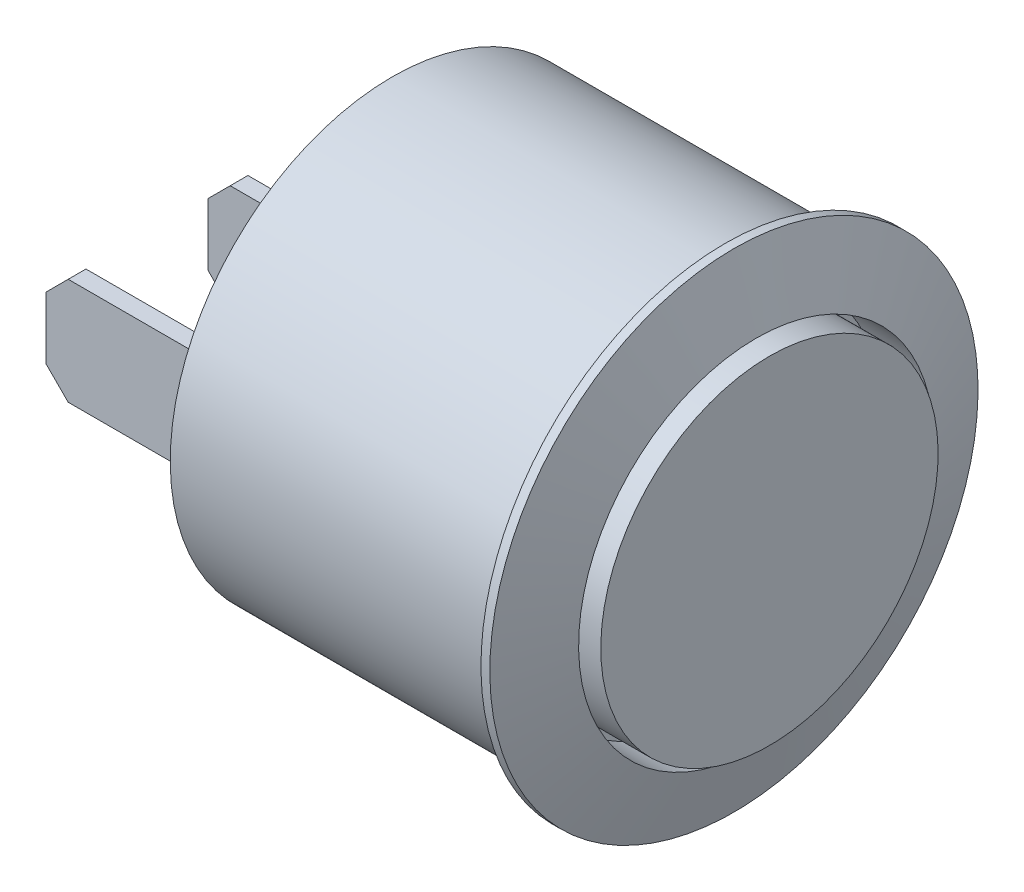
ISO-10303-21;
HEADER;
FILE_DESCRIPTION(('STEP AP214'),'2;1');
FILE_NAME('part.step','',(''),(''),'','','');
FILE_SCHEMA(('AUTOMOTIVE_DESIGN { 1 0 10303 214 1 1 1 1 }'));
ENDSEC;
DATA;
#1=APPLICATION_CONTEXT('core data for automotive mechanical design processes');
#2=APPLICATION_PROTOCOL_DEFINITION('international standard','automotive_design',2000,#1);
#3=PRODUCT_CONTEXT('',#1,'mechanical');
#4=PRODUCT('Part','Part','',(#3));
#5=PRODUCT_RELATED_PRODUCT_CATEGORY('part','',(#4));
#6=PRODUCT_DEFINITION_FORMATION('','',#4);
#7=PRODUCT_DEFINITION_CONTEXT('part definition',#1,'design');
#8=PRODUCT_DEFINITION('design','',#6,#7);
#9=PRODUCT_DEFINITION_SHAPE('','',#8);
#10=(LENGTH_UNIT() NAMED_UNIT(*) SI_UNIT(.MILLI.,.METRE.));
#11=(NAMED_UNIT(*) PLANE_ANGLE_UNIT() SI_UNIT($,.RADIAN.));
#12=(NAMED_UNIT(*) SI_UNIT($,.STERADIAN.) SOLID_ANGLE_UNIT());
#13=UNCERTAINTY_MEASURE_WITH_UNIT(LENGTH_MEASURE(1.E-05),#10,'distance_accuracy_value','');
#14=(GEOMETRIC_REPRESENTATION_CONTEXT(3) GLOBAL_UNCERTAINTY_ASSIGNED_CONTEXT((#13)) GLOBAL_UNIT_ASSIGNED_CONTEXT((#10,
#11,#12)) REPRESENTATION_CONTEXT('',''));
#15=CARTESIAN_POINT('',(0.,0.,0.));
#16=DIRECTION('',(0.,0.,1.));
#17=DIRECTION('',(1.,0.,0.));
#18=AXIS2_PLACEMENT_3D('',#15,#16,#17);
#19=CARTESIAN_POINT('',(-33.2098061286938,0.,0.));
#20=DIRECTION('',(-1.,0.,0.));
#21=DIRECTION('',(0.,-1.,0.));
#22=AXIS2_PLACEMENT_3D('',#19,#20,#21);
#23=PLANE('',#22);
#24=DIRECTION('',(0.,0.,1.));
#25=VECTOR('',#24,1.);
#26=CARTESIAN_POINT('',(-33.2098061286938,-2.4,6.8));
#27=LINE('',#26,#25);
#28=CARTESIAN_POINT('',(-33.2098061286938,-2.4,6.8));
#29=VERTEX_POINT('',#28);
#30=CARTESIAN_POINT('',(-33.2098061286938,-2.4,7.6));
#31=VERTEX_POINT('',#30);
#32=EDGE_CURVE('E202',#29,#31,#27,.T.);
#33=ORIENTED_EDGE('',*,*,#32,.F.);
#34=DIRECTION('',(0.,-1.,0.));
#35=VECTOR('',#34,1.);
#36=CARTESIAN_POINT('',(-33.2098061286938,2.4,6.8));
#37=LINE('',#36,#35);
#38=CARTESIAN_POINT('',(-33.2098061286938,2.4,6.8));
#39=VERTEX_POINT('',#38);
#40=EDGE_CURVE('E166',#39,#29,#37,.T.);
#41=ORIENTED_EDGE('',*,*,#40,.F.);
#42=DIRECTION('',(0.,0.,-1.));
#43=VECTOR('',#42,1.);
#44=CARTESIAN_POINT('',(-33.2098061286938,2.4,6.8));
#45=LINE('',#44,#43);
#46=CARTESIAN_POINT('',(-33.2098061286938,2.4,7.6));
#47=VERTEX_POINT('',#46);
#48=EDGE_CURVE('E196',#47,#39,#45,.T.);
#49=ORIENTED_EDGE('',*,*,#48,.F.);
#50=DIRECTION('',(0.,1.,0.));
#51=VECTOR('',#50,1.);
#52=CARTESIAN_POINT('',(-33.2098061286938,2.4,7.6));
#53=LINE('',#52,#51);
#54=EDGE_CURVE('E205',#31,#47,#53,.T.);
#55=ORIENTED_EDGE('',*,*,#54,.F.);
#56=EDGE_LOOP('',(#33,#41,#49,#55));
#57=FACE_BOUND('',#56,.T.);
#58=CARTESIAN_POINT('',(-33.2098061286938,0.,0.));
#59=DIRECTION('',(1.,0.,0.));
#60=DIRECTION('',(0.,1.,0.));
#61=AXIS2_PLACEMENT_3D('',#58,#59,#60);
#62=CIRCLE('',#61,10.);
#63=CARTESIAN_POINT('',(-33.2098061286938,10.,0.));
#64=VERTEX_POINT('',#63);
#65=EDGE_CURVE('E264',#64,#64,#62,.T.);
#66=ORIENTED_EDGE('',*,*,#65,.F.);
#67=EDGE_LOOP('',(#66));
#68=FACE_BOUND('',#67,.T.);
#69=DIRECTION('',(0.,0.,1.));
#70=VECTOR('',#69,1.);
#71=CARTESIAN_POINT('',(-33.2098061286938,-2.4,-0.5));
#72=LINE('',#71,#70);
#73=CARTESIAN_POINT('',(-33.2098061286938,-2.4,-0.5));
#74=VERTEX_POINT('',#73);
#75=CARTESIAN_POINT('',(-33.2098061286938,-2.4,0.3));
#76=VERTEX_POINT('',#75);
#77=EDGE_CURVE('E228',#74,#76,#72,.T.);
#78=ORIENTED_EDGE('',*,*,#77,.F.);
#79=DIRECTION('',(0.,-1.,0.));
#80=VECTOR('',#79,1.);
#81=CARTESIAN_POINT('',(-33.2098061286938,2.4,-0.5));
#82=LINE('',#81,#80);
#83=CARTESIAN_POINT('',(-33.2098061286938,2.4,-0.5));
#84=VERTEX_POINT('',#83);
#85=EDGE_CURVE('E217',#84,#74,#82,.T.);
#86=ORIENTED_EDGE('',*,*,#85,.F.);
#87=DIRECTION('',(0.,0.,-1.));
#88=VECTOR('',#87,1.);
#89=CARTESIAN_POINT('',(-33.2098061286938,2.4,-0.5));
#90=LINE('',#89,#88);
#91=CARTESIAN_POINT('',(-33.2098061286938,2.4,0.3));
#92=VERTEX_POINT('',#91);
#93=EDGE_CURVE('E222',#92,#84,#90,.T.);
#94=ORIENTED_EDGE('',*,*,#93,.F.);
#95=DIRECTION('',(0.,1.,0.));
#96=VECTOR('',#95,1.);
#97=CARTESIAN_POINT('',(-33.2098061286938,2.4,0.3));
#98=LINE('',#97,#96);
#99=EDGE_CURVE('E231',#76,#92,#98,.T.);
#100=ORIENTED_EDGE('',*,*,#99,.F.);
#101=EDGE_LOOP('',(#78,#86,#94,#100));
#102=FACE_BOUND('',#101,.T.);
#103=DIRECTION('',(0.,-1.,0.));
#104=VECTOR('',#103,1.);
#105=CARTESIAN_POINT('',(-33.2098061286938,2.4,-7.8));
#106=LINE('',#105,#104);
#107=CARTESIAN_POINT('',(-33.2098061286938,2.4,-7.8));
#108=VERTEX_POINT('',#107);
#109=CARTESIAN_POINT('',(-33.2098061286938,-2.4,-7.8));
#110=VERTEX_POINT('',#109);
#111=EDGE_CURVE('E162',#108,#110,#106,.T.);
#112=ORIENTED_EDGE('',*,*,#111,.F.);
#113=DIRECTION('',(0.,0.,-1.));
#114=VECTOR('',#113,1.);
#115=CARTESIAN_POINT('',(-33.2098061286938,2.4,-7.));
#116=LINE('',#115,#114);
#117=CARTESIAN_POINT('',(-33.2098061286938,2.4,-7.));
#118=VERTEX_POINT('',#117);
#119=EDGE_CURVE('E170',#118,#108,#116,.T.);
#120=ORIENTED_EDGE('',*,*,#119,.F.);
#121=DIRECTION('',(0.,1.,0.));
#122=VECTOR('',#121,1.);
#123=CARTESIAN_POINT('',(-33.2098061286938,2.4,-7.));
#124=LINE('',#123,#122);
#125=CARTESIAN_POINT('',(-33.2098061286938,-2.4,-7.));
#126=VERTEX_POINT('',#125);
#127=EDGE_CURVE('E181',#126,#118,#124,.T.);
#128=ORIENTED_EDGE('',*,*,#127,.F.);
#129=DIRECTION('',(0.,0.,1.));
#130=VECTOR('',#129,1.);
#131=CARTESIAN_POINT('',(-33.2098061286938,-2.4,-7.));
#132=LINE('',#131,#130);
#133=EDGE_CURVE('E179',#110,#126,#132,.T.);
#134=ORIENTED_EDGE('',*,*,#133,.F.);
#135=EDGE_LOOP('',(#112,#120,#128,#134));
#136=FACE_BOUND('',#135,.T.);
#137=ADVANCED_FACE('F35',(#57,#68,#102,#136),#23,.T.);
#138=CARTESIAN_POINT('',(-19.2098061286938,8.,0.));
#139=DIRECTION('',(1.,0.,0.));
#140=DIRECTION('',(0.,1.,0.));
#141=AXIS2_PLACEMENT_3D('',#138,#139,#140);
#142=PLANE('',#141);
#143=CARTESIAN_POINT('',(-19.2098061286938,0.,0.));
#144=DIRECTION('',(1.,0.,0.));
#145=DIRECTION('',(0.,1.,0.));
#146=AXIS2_PLACEMENT_3D('',#143,#144,#145);
#147=CIRCLE('',#146,8.);
#148=CARTESIAN_POINT('',(-19.2098061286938,8.,0.));
#149=VERTEX_POINT('',#148);
#150=EDGE_CURVE('E247',#149,#149,#147,.T.);
#151=ORIENTED_EDGE('',*,*,#150,.T.);
#152=EDGE_LOOP('',(#151));
#153=FACE_BOUND('',#152,.T.);
#154=CARTESIAN_POINT('',(-19.2098061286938,0.,0.));
#155=DIRECTION('',(1.,0.,0.));
#156=DIRECTION('',(0.,1.,0.));
#157=AXIS2_PLACEMENT_3D('',#154,#155,#156);
#158=CIRCLE('',#157,7.6);
#159=CARTESIAN_POINT('',(-19.2098061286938,7.6,0.));
#160=VERTEX_POINT('',#159);
#161=EDGE_CURVE('E243',#160,#160,#158,.T.);
#162=ORIENTED_EDGE('',*,*,#161,.F.);
#163=EDGE_LOOP('',(#162));
#164=FACE_BOUND('',#163,.T.);
#165=ADVANCED_FACE('F336',(#153,#164),#142,.T.);
#166=CARTESIAN_POINT('',(-19.2098061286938,0.,0.));
#167=DIRECTION('',(1.,0.,0.));
#168=DIRECTION('',(0.,1.,0.));
#169=AXIS2_PLACEMENT_3D('',#166,#167,#168);
#170=CYLINDRICAL_SURFACE('',#169,10.);
#171=ORIENTED_EDGE('',*,*,#65,.T.);
#172=EDGE_LOOP('',(#171));
#173=FACE_BOUND('',#172,.T.);
#174=CARTESIAN_POINT('',(-18.2098061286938,0.,0.));
#175=DIRECTION('',(1.,0.,0.));
#176=DIRECTION('',(0.,1.,0.));
#177=AXIS2_PLACEMENT_3D('',#174,#175,#176);
#178=CIRCLE('',#177,10.);
#179=CARTESIAN_POINT('',(-18.2098061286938,10.,0.));
#180=VERTEX_POINT('',#179);
#181=EDGE_CURVE('E261',#180,#180,#178,.T.);
#182=ORIENTED_EDGE('',*,*,#181,.F.);
#183=EDGE_LOOP('',(#182));
#184=FACE_BOUND('',#183,.T.);
#185=ADVANCED_FACE('F342',(#173,#184),#170,.T.);
#186=CARTESIAN_POINT('',(-18.2098061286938,10.,0.));
#187=DIRECTION('',(-1.,0.,0.));
#188=DIRECTION('',(0.,-1.,0.));
#189=AXIS2_PLACEMENT_3D('',#186,#187,#188);
#190=PLANE('',#189);
#191=ORIENTED_EDGE('',*,*,#181,.T.);
#192=EDGE_LOOP('',(#191));
#193=FACE_BOUND('',#192,.T.);
#194=CARTESIAN_POINT('',(-18.2098061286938,0.,0.));
#195=DIRECTION('',(1.,0.,0.));
#196=DIRECTION('',(0.,1.,0.));
#197=AXIS2_PLACEMENT_3D('',#194,#195,#196);
#198=CIRCLE('',#197,11.);
#199=CARTESIAN_POINT('',(-18.2098061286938,11.,0.));
#200=VERTEX_POINT('',#199);
#201=EDGE_CURVE('E258',#200,#200,#198,.T.);
#202=ORIENTED_EDGE('',*,*,#201,.F.);
#203=EDGE_LOOP('',(#202));
#204=FACE_BOUND('',#203,.T.);
#205=ADVANCED_FACE('F423',(#193,#204),#190,.T.);
#206=CARTESIAN_POINT('',(-19.2098061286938,0.,0.));
#207=DIRECTION('',(1.,0.,0.));
#208=DIRECTION('',(0.,1.,0.));
#209=AXIS2_PLACEMENT_3D('',#206,#207,#208);
#210=CYLINDRICAL_SURFACE('',#209,11.);
#211=ORIENTED_EDGE('',*,*,#201,.T.);
#212=EDGE_LOOP('',(#211));
#213=FACE_BOUND('',#212,.T.);
#214=CARTESIAN_POINT('',(-17.8098061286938,0.,0.));
#215=DIRECTION('',(1.,0.,0.));
#216=DIRECTION('',(0.,1.,0.));
#217=AXIS2_PLACEMENT_3D('',#214,#215,#216);
#218=CIRCLE('',#217,11.);
#219=CARTESIAN_POINT('',(-17.8098061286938,11.,0.));
#220=VERTEX_POINT('',#219);
#221=EDGE_CURVE('E255',#220,#220,#218,.T.);
#222=ORIENTED_EDGE('',*,*,#221,.F.);
#223=EDGE_LOOP('',(#222));
#224=FACE_BOUND('',#223,.T.);
#225=ADVANCED_FACE('F420',(#213,#224),#210,.T.);
#226=CARTESIAN_POINT('',(-16.8098061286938,0.,0.));
#227=DIRECTION('',(-1.,0.,0.));
#228=DIRECTION('',(0.,-1.,0.));
#229=AXIS2_PLACEMENT_3D('',#226,#227,#228);
#230=CONICAL_SURFACE('',#229,8.,1.24904577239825);
#231=ORIENTED_EDGE('',*,*,#221,.T.);
#232=EDGE_LOOP('',(#231));
#233=FACE_BOUND('',#232,.T.);
#234=CARTESIAN_POINT('',(-16.8098061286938,0.,0.));
#235=DIRECTION('',(1.,0.,0.));
#236=DIRECTION('',(0.,1.,0.));
#237=AXIS2_PLACEMENT_3D('',#234,#235,#236);
#238=CIRCLE('',#237,8.);
#239=CARTESIAN_POINT('',(-16.8098061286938,8.,0.));
#240=VERTEX_POINT('',#239);
#241=EDGE_CURVE('E252',#240,#240,#238,.T.);
#242=ORIENTED_EDGE('',*,*,#241,.F.);
#243=EDGE_LOOP('',(#242));
#244=FACE_BOUND('',#243,.T.);
#245=ADVANCED_FACE('F416',(#233,#244),#230,.T.);
#246=CARTESIAN_POINT('',(-19.2098061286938,0.,0.));
#247=DIRECTION('',(1.,0.,0.));
#248=DIRECTION('',(0.,1.,0.));
#249=AXIS2_PLACEMENT_3D('',#246,#247,#248);
#250=CYLINDRICAL_SURFACE('',#249,8.);
#251=ORIENTED_EDGE('',*,*,#241,.T.);
#252=EDGE_LOOP('',(#251));
#253=FACE_BOUND('',#252,.T.);
#254=ORIENTED_EDGE('',*,*,#150,.F.);
#255=EDGE_LOOP('',(#254));
#256=FACE_BOUND('',#255,.T.);
#257=ADVANCED_FACE('F411',(#253,#256),#250,.F.);
#258=CARTESIAN_POINT('',(-16.2098061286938,0.,0.));
#259=DIRECTION('',(-1.,0.,0.));
#260=DIRECTION('',(0.,-1.,0.));
#261=AXIS2_PLACEMENT_3D('',#258,#259,#260);
#262=CYLINDRICAL_SURFACE('',#261,7.6);
#263=CARTESIAN_POINT('',(-16.2098061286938,0.,0.));
#264=DIRECTION('',(1.,0.,0.));
#265=DIRECTION('',(0.,1.,0.));
#266=AXIS2_PLACEMENT_3D('',#263,#264,#265);
#267=CIRCLE('',#266,7.6);
#268=CARTESIAN_POINT('',(-16.2098061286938,7.6,0.));
#269=VERTEX_POINT('',#268);
#270=EDGE_CURVE('E244',#269,#269,#267,.T.);
#271=ORIENTED_EDGE('',*,*,#270,.F.);
#272=EDGE_LOOP('',(#271));
#273=FACE_BOUND('',#272,.T.);
#274=ORIENTED_EDGE('',*,*,#161,.T.);
#275=EDGE_LOOP('',(#274));
#276=FACE_BOUND('',#275,.T.);
#277=ADVANCED_FACE('F408',(#273,#276),#262,.T.);
#278=CARTESIAN_POINT('',(-16.2098061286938,0.,0.));
#279=DIRECTION('',(1.,0.,0.));
#280=DIRECTION('',(0.,1.,0.));
#281=AXIS2_PLACEMENT_3D('',#278,#279,#280);
#282=PLANE('',#281);
#283=ORIENTED_EDGE('',*,*,#270,.T.);
#284=EDGE_LOOP('',(#283));
#285=FACE_BOUND('',#284,.T.);
#286=ADVANCED_FACE('F405',(#285),#282,.T.);
#287=CARTESIAN_POINT('',(-41.2098061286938,2.4,-0.5));
#288=DIRECTION('',(0.,0.,1.));
#289=DIRECTION('',(0.,-1.,0.));
#290=AXIS2_PLACEMENT_3D('',#287,#288,#289);
#291=PLANE('',#290);
#292=DIRECTION('',(0.,-1.,0.));
#293=VECTOR('',#292,1.);
#294=CARTESIAN_POINT('',(-41.2098061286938,2.4,-0.5));
#295=LINE('',#294,#293);
#296=CARTESIAN_POINT('',(-41.2098061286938,1.39999999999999,-0.5));
#297=VERTEX_POINT('',#296);
#298=CARTESIAN_POINT('',(-41.2098061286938,-1.4,-0.5));
#299=VERTEX_POINT('',#298);
#300=EDGE_CURVE('E218',#297,#299,#295,.T.);
#301=ORIENTED_EDGE('',*,*,#300,.F.);
#302=DIRECTION('',(0.70710678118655,0.707106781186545,0.));
#303=VECTOR('',#302,1.);
#304=CARTESIAN_POINT('',(-41.2098061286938,1.39999999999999,-0.5));
#305=LINE('',#304,#303);
#306=CARTESIAN_POINT('',(-40.2098061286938,2.4,-0.5));
#307=VERTEX_POINT('',#306);
#308=EDGE_CURVE('E293',#297,#307,#305,.T.);
#309=ORIENTED_EDGE('',*,*,#308,.T.);
#310=DIRECTION('',(1.,0.,0.));
#311=VECTOR('',#310,1.);
#312=CARTESIAN_POINT('',(-41.2098061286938,2.4,-0.5));
#313=LINE('',#312,#311);
#314=EDGE_CURVE('E225',#307,#84,#313,.T.);
#315=ORIENTED_EDGE('',*,*,#314,.T.);
#316=ORIENTED_EDGE('',*,*,#85,.T.);
#317=DIRECTION('',(1.,0.,0.));
#318=VECTOR('',#317,1.);
#319=CARTESIAN_POINT('',(-41.2098061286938,-2.4,-0.5));
#320=LINE('',#319,#318);
#321=CARTESIAN_POINT('',(-40.2098061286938,-2.4,-0.5));
#322=VERTEX_POINT('',#321);
#323=EDGE_CURVE('E241',#322,#74,#320,.T.);
#324=ORIENTED_EDGE('',*,*,#323,.F.);
#325=DIRECTION('',(-0.70710678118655,0.707106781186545,0.));
#326=VECTOR('',#325,1.);
#327=CARTESIAN_POINT('',(-41.2098061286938,-1.4,-0.5));
#328=LINE('',#327,#326);
#329=EDGE_CURVE('E291',#322,#299,#328,.T.);
#330=ORIENTED_EDGE('',*,*,#329,.T.);
#331=EDGE_LOOP('',(#301,#309,#315,#316,#324,#330));
#332=FACE_BOUND('',#331,.T.);
#333=ADVANCED_FACE('F372',(#332),#291,.F.);
#334=CARTESIAN_POINT('',(-41.2098061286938,-2.4,-0.5));
#335=DIRECTION('',(0.,1.,0.));
#336=DIRECTION('',(-1.,0.,0.));
#337=AXIS2_PLACEMENT_3D('',#334,#335,#336);
#338=PLANE('',#337);
#339=DIRECTION('',(1.,0.,0.));
#340=VECTOR('',#339,1.);
#341=CARTESIAN_POINT('',(-41.2098061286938,-2.4,0.3));
#342=LINE('',#341,#340);
#343=CARTESIAN_POINT('',(-40.2098061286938,-2.4,0.3));
#344=VERTEX_POINT('',#343);
#345=EDGE_CURVE('E239',#344,#76,#342,.T.);
#346=ORIENTED_EDGE('',*,*,#345,.F.);
#347=DIRECTION('',(0.,0.,-1.));
#348=VECTOR('',#347,1.);
#349=CARTESIAN_POINT('',(-40.2098061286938,-2.4,-0.5));
#350=LINE('',#349,#348);
#351=EDGE_CURVE('E301',#344,#322,#350,.T.);
#352=ORIENTED_EDGE('',*,*,#351,.T.);
#353=ORIENTED_EDGE('',*,*,#323,.T.);
#354=ORIENTED_EDGE('',*,*,#77,.T.);
#355=EDGE_LOOP('',(#346,#352,#353,#354));
#356=FACE_BOUND('',#355,.T.);
#357=ADVANCED_FACE('F390',(#356),#338,.F.);
#358=CARTESIAN_POINT('',(-41.2098061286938,2.4,0.3));
#359=DIRECTION('',(0.,0.,-1.));
#360=DIRECTION('',(0.,1.,0.));
#361=AXIS2_PLACEMENT_3D('',#358,#359,#360);
#362=PLANE('',#361);
#363=DIRECTION('',(1.,0.,0.));
#364=VECTOR('',#363,1.);
#365=CARTESIAN_POINT('',(-41.2098061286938,2.4,0.3));
#366=LINE('',#365,#364);
#367=CARTESIAN_POINT('',(-40.2098061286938,2.4,0.3));
#368=VERTEX_POINT('',#367);
#369=EDGE_CURVE('E237',#368,#92,#366,.T.);
#370=ORIENTED_EDGE('',*,*,#369,.F.);
#371=DIRECTION('',(-0.70710678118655,-0.707106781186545,0.));
#372=VECTOR('',#371,1.);
#373=CARTESIAN_POINT('',(-41.2098061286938,1.39999999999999,0.3));
#374=LINE('',#373,#372);
#375=CARTESIAN_POINT('',(-41.2098061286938,1.39999999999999,0.3));
#376=VERTEX_POINT('',#375);
#377=EDGE_CURVE('E299',#368,#376,#374,.T.);
#378=ORIENTED_EDGE('',*,*,#377,.T.);
#379=DIRECTION('',(0.,1.,0.));
#380=VECTOR('',#379,1.);
#381=CARTESIAN_POINT('',(-41.2098061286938,2.4,0.3));
#382=LINE('',#381,#380);
#383=CARTESIAN_POINT('',(-41.2098061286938,-1.4,0.3));
#384=VERTEX_POINT('',#383);
#385=EDGE_CURVE('E221',#384,#376,#382,.T.);
#386=ORIENTED_EDGE('',*,*,#385,.F.);
#387=DIRECTION('',(0.70710678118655,-0.707106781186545,0.));
#388=VECTOR('',#387,1.);
#389=CARTESIAN_POINT('',(-41.2098061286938,-1.4,0.3));
#390=LINE('',#389,#388);
#391=EDGE_CURVE('E297',#384,#344,#390,.T.);
#392=ORIENTED_EDGE('',*,*,#391,.T.);
#393=ORIENTED_EDGE('',*,*,#345,.T.);
#394=ORIENTED_EDGE('',*,*,#99,.T.);
#395=EDGE_LOOP('',(#370,#378,#386,#392,#393,#394));
#396=FACE_BOUND('',#395,.T.);
#397=ADVANCED_FACE('F392',(#396),#362,.F.);
#398=CARTESIAN_POINT('',(-41.2098061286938,2.4,-0.5));
#399=DIRECTION('',(0.,-1.,0.));
#400=DIRECTION('',(1.,0.,0.));
#401=AXIS2_PLACEMENT_3D('',#398,#399,#400);
#402=PLANE('',#401);
#403=ORIENTED_EDGE('',*,*,#314,.F.);
#404=DIRECTION('',(0.,0.,1.));
#405=VECTOR('',#404,1.);
#406=CARTESIAN_POINT('',(-40.2098061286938,2.4,0.3));
#407=LINE('',#406,#405);
#408=EDGE_CURVE('E295',#307,#368,#407,.T.);
#409=ORIENTED_EDGE('',*,*,#408,.T.);
#410=ORIENTED_EDGE('',*,*,#369,.T.);
#411=ORIENTED_EDGE('',*,*,#93,.T.);
#412=EDGE_LOOP('',(#403,#409,#410,#411));
#413=FACE_BOUND('',#412,.T.);
#414=ADVANCED_FACE('F381',(#413),#402,.F.);
#415=CARTESIAN_POINT('',(-41.2098061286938,0.,0.));
#416=DIRECTION('',(-1.,0.,0.));
#417=DIRECTION('',(0.,0.,1.));
#418=AXIS2_PLACEMENT_3D('',#415,#416,#417);
#419=PLANE('',#418);
#420=ORIENTED_EDGE('',*,*,#385,.T.);
#421=DIRECTION('',(0.,0.,-1.));
#422=VECTOR('',#421,1.);
#423=CARTESIAN_POINT('',(-41.2098061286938,1.39999999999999,-0.5));
#424=LINE('',#423,#422);
#425=EDGE_CURVE('E288',#376,#297,#424,.T.);
#426=ORIENTED_EDGE('',*,*,#425,.T.);
#427=ORIENTED_EDGE('',*,*,#300,.T.);
#428=DIRECTION('',(0.,0.,1.));
#429=VECTOR('',#428,1.);
#430=CARTESIAN_POINT('',(-41.2098061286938,-1.4,0.3));
#431=LINE('',#430,#429);
#432=EDGE_CURVE('E285',#299,#384,#431,.T.);
#433=ORIENTED_EDGE('',*,*,#432,.T.);
#434=EDGE_LOOP('',(#420,#426,#427,#433));
#435=FACE_BOUND('',#434,.T.);
#436=ADVANCED_FACE('F374',(#435),#419,.T.);
#437=CARTESIAN_POINT('',(-41.2098061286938,2.4,6.8));
#438=DIRECTION('',(0.,0.,1.));
#439=DIRECTION('',(1.,0.,0.));
#440=AXIS2_PLACEMENT_3D('',#437,#438,#439);
#441=PLANE('',#440);
#442=DIRECTION('',(1.,0.,0.));
#443=VECTOR('',#442,1.);
#444=CARTESIAN_POINT('',(-41.2098061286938,-2.4,6.8));
#445=LINE('',#444,#443);
#446=CARTESIAN_POINT('',(-40.2098061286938,-2.4,6.8));
#447=VERTEX_POINT('',#446);
#448=EDGE_CURVE('E215',#447,#29,#445,.T.);
#449=ORIENTED_EDGE('',*,*,#448,.F.);
#450=DIRECTION('',(-0.70710678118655,0.707106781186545,0.));
#451=VECTOR('',#450,1.);
#452=CARTESIAN_POINT('',(-41.2098061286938,-1.4,6.8));
#453=LINE('',#452,#451);
#454=CARTESIAN_POINT('',(-41.2098061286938,-1.4,6.8));
#455=VERTEX_POINT('',#454);
#456=EDGE_CURVE('E281',#447,#455,#453,.T.);
#457=ORIENTED_EDGE('',*,*,#456,.T.);
#458=DIRECTION('',(0.,-1.,0.));
#459=VECTOR('',#458,1.);
#460=CARTESIAN_POINT('',(-41.2098061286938,2.4,6.8));
#461=LINE('',#460,#459);
#462=CARTESIAN_POINT('',(-41.2098061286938,1.39999999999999,6.8));
#463=VERTEX_POINT('',#462);
#464=EDGE_CURVE('E192',#463,#455,#461,.T.);
#465=ORIENTED_EDGE('',*,*,#464,.F.);
#466=DIRECTION('',(0.70710678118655,0.707106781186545,0.));
#467=VECTOR('',#466,1.);
#468=CARTESIAN_POINT('',(-41.2098061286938,1.39999999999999,6.8));
#469=LINE('',#468,#467);
#470=CARTESIAN_POINT('',(-40.2098061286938,2.4,6.8));
#471=VERTEX_POINT('',#470);
#472=EDGE_CURVE('E279',#463,#471,#469,.T.);
#473=ORIENTED_EDGE('',*,*,#472,.T.);
#474=DIRECTION('',(1.,0.,0.));
#475=VECTOR('',#474,1.);
#476=CARTESIAN_POINT('',(-41.2098061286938,2.4,6.8));
#477=LINE('',#476,#475);
#478=EDGE_CURVE('E199',#471,#39,#477,.T.);
#479=ORIENTED_EDGE('',*,*,#478,.T.);
#480=ORIENTED_EDGE('',*,*,#40,.T.);
#481=EDGE_LOOP('',(#449,#457,#465,#473,#479,#480));
#482=FACE_BOUND('',#481,.T.);
#483=ADVANCED_FACE('F533',(#482),#441,.F.);
#484=CARTESIAN_POINT('',(-41.2098061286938,-2.4,6.8));
#485=DIRECTION('',(0.,1.,0.));
#486=DIRECTION('',(-1.,0.,0.));
#487=AXIS2_PLACEMENT_3D('',#484,#485,#486);
#488=PLANE('',#487);
#489=DIRECTION('',(1.,0.,0.));
#490=VECTOR('',#489,1.);
#491=CARTESIAN_POINT('',(-41.2098061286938,-2.4,7.6));
#492=LINE('',#491,#490);
#493=CARTESIAN_POINT('',(-40.2098061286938,-2.4,7.6));
#494=VERTEX_POINT('',#493);
#495=EDGE_CURVE('E213',#494,#31,#492,.T.);
#496=ORIENTED_EDGE('',*,*,#495,.F.);
#497=DIRECTION('',(0.,0.,-1.));
#498=VECTOR('',#497,1.);
#499=CARTESIAN_POINT('',(-40.2098061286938,-2.4,6.8));
#500=LINE('',#499,#498);
#501=EDGE_CURVE('E277',#494,#447,#500,.T.);
#502=ORIENTED_EDGE('',*,*,#501,.T.);
#503=ORIENTED_EDGE('',*,*,#448,.T.);
#504=ORIENTED_EDGE('',*,*,#32,.T.);
#505=EDGE_LOOP('',(#496,#502,#503,#504));
#506=FACE_BOUND('',#505,.T.);
#507=ADVANCED_FACE('F540',(#506),#488,.F.);
#508=CARTESIAN_POINT('',(-41.2098061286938,2.4,7.6));
#509=DIRECTION('',(0.,0.,-1.));
#510=DIRECTION('',(0.,1.,0.));
#511=AXIS2_PLACEMENT_3D('',#508,#509,#510);
#512=PLANE('',#511);
#513=DIRECTION('',(0.,1.,0.));
#514=VECTOR('',#513,1.);
#515=CARTESIAN_POINT('',(-41.2098061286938,2.4,7.6));
#516=LINE('',#515,#514);
#517=CARTESIAN_POINT('',(-41.2098061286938,-1.4,7.6));
#518=VERTEX_POINT('',#517);
#519=CARTESIAN_POINT('',(-41.2098061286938,1.39999999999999,7.6));
#520=VERTEX_POINT('',#519);
#521=EDGE_CURVE('E195',#518,#520,#516,.T.);
#522=ORIENTED_EDGE('',*,*,#521,.F.);
#523=DIRECTION('',(0.70710678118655,-0.707106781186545,0.));
#524=VECTOR('',#523,1.);
#525=CARTESIAN_POINT('',(-41.2098061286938,-1.4,7.6));
#526=LINE('',#525,#524);
#527=EDGE_CURVE('E275',#518,#494,#526,.T.);
#528=ORIENTED_EDGE('',*,*,#527,.T.);
#529=ORIENTED_EDGE('',*,*,#495,.T.);
#530=ORIENTED_EDGE('',*,*,#54,.T.);
#531=DIRECTION('',(1.,0.,0.));
#532=VECTOR('',#531,1.);
#533=CARTESIAN_POINT('',(-41.2098061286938,2.4,7.6));
#534=LINE('',#533,#532);
#535=CARTESIAN_POINT('',(-40.2098061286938,2.4,7.6));
#536=VERTEX_POINT('',#535);
#537=EDGE_CURVE('E211',#536,#47,#534,.T.);
#538=ORIENTED_EDGE('',*,*,#537,.F.);
#539=DIRECTION('',(-0.70710678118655,-0.707106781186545,0.));
#540=VECTOR('',#539,1.);
#541=CARTESIAN_POINT('',(-41.2098061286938,1.39999999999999,7.6));
#542=LINE('',#541,#540);
#543=EDGE_CURVE('E273',#536,#520,#542,.T.);
#544=ORIENTED_EDGE('',*,*,#543,.T.);
#545=EDGE_LOOP('',(#522,#528,#529,#530,#538,#544));
#546=FACE_BOUND('',#545,.T.);
#547=ADVANCED_FACE('F549',(#546),#512,.F.);
#548=CARTESIAN_POINT('',(-41.2098061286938,2.4,6.8));
#549=DIRECTION('',(0.,-1.,0.));
#550=DIRECTION('',(0.,0.,-1.));
#551=AXIS2_PLACEMENT_3D('',#548,#549,#550);
#552=PLANE('',#551);
#553=ORIENTED_EDGE('',*,*,#478,.F.);
#554=DIRECTION('',(0.,0.,1.));
#555=VECTOR('',#554,1.);
#556=CARTESIAN_POINT('',(-40.2098061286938,2.4,7.6));
#557=LINE('',#556,#555);
#558=EDGE_CURVE('E283',#471,#536,#557,.T.);
#559=ORIENTED_EDGE('',*,*,#558,.T.);
#560=ORIENTED_EDGE('',*,*,#537,.T.);
#561=ORIENTED_EDGE('',*,*,#48,.T.);
#562=EDGE_LOOP('',(#553,#559,#560,#561));
#563=FACE_BOUND('',#562,.T.);
#564=ADVANCED_FACE('F558',(#563),#552,.F.);
#565=CARTESIAN_POINT('',(-41.2098061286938,0.,0.));
#566=DIRECTION('',(-1.,0.,0.));
#567=DIRECTION('',(0.,0.,1.));
#568=AXIS2_PLACEMENT_3D('',#565,#566,#567);
#569=PLANE('',#568);
#570=ORIENTED_EDGE('',*,*,#464,.T.);
#571=DIRECTION('',(0.,0.,1.));
#572=VECTOR('',#571,1.);
#573=CARTESIAN_POINT('',(-41.2098061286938,-1.4,7.6));
#574=LINE('',#573,#572);
#575=EDGE_CURVE('E270',#455,#518,#574,.T.);
#576=ORIENTED_EDGE('',*,*,#575,.T.);
#577=ORIENTED_EDGE('',*,*,#521,.T.);
#578=DIRECTION('',(0.,0.,-1.));
#579=VECTOR('',#578,1.);
#580=CARTESIAN_POINT('',(-41.2098061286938,1.39999999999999,6.8));
#581=LINE('',#580,#579);
#582=EDGE_CURVE('E267',#520,#463,#581,.T.);
#583=ORIENTED_EDGE('',*,*,#582,.T.);
#584=EDGE_LOOP('',(#570,#576,#577,#583));
#585=FACE_BOUND('',#584,.T.);
#586=ADVANCED_FACE('F567',(#585),#569,.T.);
#587=CARTESIAN_POINT('',(-41.2098061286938,2.4,-7.));
#588=DIRECTION('',(0.,-1.,0.));
#589=DIRECTION('',(0.,0.,-1.));
#590=AXIS2_PLACEMENT_3D('',#587,#588,#589);
#591=PLANE('',#590);
#592=DIRECTION('',(1.,0.,0.));
#593=VECTOR('',#592,1.);
#594=CARTESIAN_POINT('',(-41.2098061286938,2.4,-7.8));
#595=LINE('',#594,#593);
#596=CARTESIAN_POINT('',(-40.2098061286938,2.4,-7.8));
#597=VERTEX_POINT('',#596);
#598=EDGE_CURVE('E158',#597,#108,#595,.T.);
#599=ORIENTED_EDGE('',*,*,#598,.F.);
#600=DIRECTION('',(0.,0.,1.));
#601=VECTOR('',#600,1.);
#602=CARTESIAN_POINT('',(-40.2098061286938,2.4,-7.));
#603=LINE('',#602,#601);
#604=CARTESIAN_POINT('',(-40.2098061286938,2.39999999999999,-7.));
#605=VERTEX_POINT('',#604);
#606=EDGE_CURVE('E11',#597,#605,#603,.T.);
#607=ORIENTED_EDGE('',*,*,#606,.T.);
#608=DIRECTION('',(1.,0.,0.));
#609=VECTOR('',#608,1.);
#610=CARTESIAN_POINT('',(-41.2098061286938,2.4,-7.));
#611=LINE('',#610,#609);
#612=EDGE_CURVE('E173',#605,#118,#611,.T.);
#613=ORIENTED_EDGE('',*,*,#612,.T.);
#614=ORIENTED_EDGE('',*,*,#119,.T.);
#615=EDGE_LOOP('',(#599,#607,#613,#614));
#616=FACE_BOUND('',#615,.T.);
#617=ADVANCED_FACE('F171',(#616),#591,.F.);
#618=CARTESIAN_POINT('',(-41.2098061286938,2.4,-7.8));
#619=DIRECTION('',(0.,0.,1.));
#620=DIRECTION('',(0.,-1.,0.));
#621=AXIS2_PLACEMENT_3D('',#618,#619,#620);
#622=PLANE('',#621);
#623=DIRECTION('',(1.,0.,0.));
#624=VECTOR('',#623,1.);
#625=CARTESIAN_POINT('',(-41.2098061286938,-2.4,-7.8));
#626=LINE('',#625,#624);
#627=CARTESIAN_POINT('',(-40.2098061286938,-2.4,-7.8));
#628=VERTEX_POINT('',#627);
#629=EDGE_CURVE('E167',#628,#110,#626,.T.);
#630=ORIENTED_EDGE('',*,*,#629,.F.);
#631=DIRECTION('',(-0.70710678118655,0.707106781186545,0.));
#632=VECTOR('',#631,1.);
#633=CARTESIAN_POINT('',(-41.2098061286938,-1.4,-7.8));
#634=LINE('',#633,#632);
#635=CARTESIAN_POINT('',(-41.2098061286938,-1.4,-7.8));
#636=VERTEX_POINT('',#635);
#637=EDGE_CURVE('E43',#628,#636,#634,.T.);
#638=ORIENTED_EDGE('',*,*,#637,.T.);
#639=DIRECTION('',(0.,-1.,0.));
#640=VECTOR('',#639,1.);
#641=CARTESIAN_POINT('',(-41.2098061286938,2.4,-7.8));
#642=LINE('',#641,#640);
#643=CARTESIAN_POINT('',(-41.2098061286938,1.39999999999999,-7.8));
#644=VERTEX_POINT('',#643);
#645=EDGE_CURVE('E186',#644,#636,#642,.T.);
#646=ORIENTED_EDGE('',*,*,#645,.F.);
#647=DIRECTION('',(0.70710678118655,0.707106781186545,0.));
#648=VECTOR('',#647,1.);
#649=CARTESIAN_POINT('',(-41.2098061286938,1.39999999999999,-7.8));
#650=LINE('',#649,#648);
#651=EDGE_CURVE('E50',#644,#597,#650,.T.);
#652=ORIENTED_EDGE('',*,*,#651,.T.);
#653=ORIENTED_EDGE('',*,*,#598,.T.);
#654=ORIENTED_EDGE('',*,*,#111,.T.);
#655=EDGE_LOOP('',(#630,#638,#646,#652,#653,#654));
#656=FACE_BOUND('',#655,.T.);
#657=ADVANCED_FACE('F160',(#656),#622,.F.);
#658=CARTESIAN_POINT('',(-41.2098061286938,-2.4,-7.));
#659=DIRECTION('',(0.,1.,0.));
#660=DIRECTION('',(-1.,0.,0.));
#661=AXIS2_PLACEMENT_3D('',#658,#659,#660);
#662=PLANE('',#661);
#663=DIRECTION('',(1.,0.,0.));
#664=VECTOR('',#663,1.);
#665=CARTESIAN_POINT('',(-41.2098061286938,-2.4,-7.));
#666=LINE('',#665,#664);
#667=CARTESIAN_POINT('',(-40.2098061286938,-2.4,-7.));
#668=VERTEX_POINT('',#667);
#669=EDGE_CURVE('E188',#668,#126,#666,.T.);
#670=ORIENTED_EDGE('',*,*,#669,.F.);
#671=DIRECTION('',(0.,0.,-1.));
#672=VECTOR('',#671,1.);
#673=CARTESIAN_POINT('',(-40.2098061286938,-2.4,-7.8));
#674=LINE('',#673,#672);
#675=EDGE_CURVE('E58',#668,#628,#674,.T.);
#676=ORIENTED_EDGE('',*,*,#675,.T.);
#677=ORIENTED_EDGE('',*,*,#629,.T.);
#678=ORIENTED_EDGE('',*,*,#133,.T.);
#679=EDGE_LOOP('',(#670,#676,#677,#678));
#680=FACE_BOUND('',#679,.T.);
#681=ADVANCED_FACE('F327',(#680),#662,.F.);
#682=CARTESIAN_POINT('',(-41.2098061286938,2.4,-7.));
#683=DIRECTION('',(0.,0.,-1.));
#684=DIRECTION('',(-1.,0.,0.));
#685=AXIS2_PLACEMENT_3D('',#682,#683,#684);
#686=PLANE('',#685);
#687=DIRECTION('',(0.,1.,0.));
#688=VECTOR('',#687,1.);
#689=CARTESIAN_POINT('',(-41.2098061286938,2.4,-7.));
#690=LINE('',#689,#688);
#691=CARTESIAN_POINT('',(-41.2098061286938,-1.4,-7.));
#692=VERTEX_POINT('',#691);
#693=CARTESIAN_POINT('',(-41.2098061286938,1.39999999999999,-7.));
#694=VERTEX_POINT('',#693);
#695=EDGE_CURVE('E189',#692,#694,#690,.T.);
#696=ORIENTED_EDGE('',*,*,#695,.F.);
#697=DIRECTION('',(0.70710678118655,-0.707106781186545,0.));
#698=VECTOR('',#697,1.);
#699=CARTESIAN_POINT('',(-41.2098061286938,-1.4,-7.));
#700=LINE('',#699,#698);
#701=EDGE_CURVE('E311',#692,#668,#700,.T.);
#702=ORIENTED_EDGE('',*,*,#701,.T.);
#703=ORIENTED_EDGE('',*,*,#669,.T.);
#704=ORIENTED_EDGE('',*,*,#127,.T.);
#705=ORIENTED_EDGE('',*,*,#612,.F.);
#706=DIRECTION('',(-0.70710678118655,-0.707106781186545,0.));
#707=VECTOR('',#706,1.);
#708=CARTESIAN_POINT('',(-41.2098061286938,1.39999999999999,-7.));
#709=LINE('',#708,#707);
#710=EDGE_CURVE('E309',#605,#694,#709,.T.);
#711=ORIENTED_EDGE('',*,*,#710,.T.);
#712=EDGE_LOOP('',(#696,#702,#703,#704,#705,#711));
#713=FACE_BOUND('',#712,.T.);
#714=ADVANCED_FACE('F326',(#713),#686,.F.);
#715=CARTESIAN_POINT('',(-41.2098061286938,0.,0.));
#716=DIRECTION('',(-1.,0.,0.));
#717=DIRECTION('',(0.,0.,1.));
#718=AXIS2_PLACEMENT_3D('',#715,#716,#717);
#719=PLANE('',#718);
#720=ORIENTED_EDGE('',*,*,#645,.T.);
#721=DIRECTION('',(0.,0.,1.));
#722=VECTOR('',#721,1.);
#723=CARTESIAN_POINT('',(-41.2098061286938,-1.4,-7.));
#724=LINE('',#723,#722);
#725=EDGE_CURVE('E306',#636,#692,#724,.T.);
#726=ORIENTED_EDGE('',*,*,#725,.T.);
#727=ORIENTED_EDGE('',*,*,#695,.T.);
#728=DIRECTION('',(0.,0.,-1.));
#729=VECTOR('',#728,1.);
#730=CARTESIAN_POINT('',(-41.2098061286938,1.39999999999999,-7.8));
#731=LINE('',#730,#729);
#732=EDGE_CURVE('E303',#694,#644,#731,.T.);
#733=ORIENTED_EDGE('',*,*,#732,.T.);
#734=EDGE_LOOP('',(#720,#726,#727,#733));
#735=FACE_BOUND('',#734,.T.);
#736=ADVANCED_FACE('F319',(#735),#719,.T.);
#737=CARTESIAN_POINT('',(-41.2098061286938,-1.4,0.));
#738=DIRECTION('',(-0.707106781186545,-0.70710678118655,0.));
#739=DIRECTION('',(0.,0.,-1.));
#740=AXIS2_PLACEMENT_3D('',#737,#738,#739);
#741=PLANE('',#740);
#742=ORIENTED_EDGE('',*,*,#456,.F.);
#743=ORIENTED_EDGE('',*,*,#501,.F.);
#744=ORIENTED_EDGE('',*,*,#527,.F.);
#745=ORIENTED_EDGE('',*,*,#575,.F.);
#746=EDGE_LOOP('',(#742,#743,#744,#745));
#747=FACE_BOUND('',#746,.T.);
#748=ADVANCED_FACE('F350',(#747),#741,.T.);
#749=CARTESIAN_POINT('',(-41.2098061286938,1.39999999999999,0.));
#750=DIRECTION('',(-0.707106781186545,0.70710678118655,0.));
#751=DIRECTION('',(0.,0.,1.));
#752=AXIS2_PLACEMENT_3D('',#749,#750,#751);
#753=PLANE('',#752);
#754=ORIENTED_EDGE('',*,*,#543,.F.);
#755=ORIENTED_EDGE('',*,*,#558,.F.);
#756=ORIENTED_EDGE('',*,*,#472,.F.);
#757=ORIENTED_EDGE('',*,*,#582,.F.);
#758=EDGE_LOOP('',(#754,#755,#756,#757));
#759=FACE_BOUND('',#758,.T.);
#760=ADVANCED_FACE('F353',(#759),#753,.T.);
#761=CARTESIAN_POINT('',(-41.2098061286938,1.39999999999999,0.));
#762=DIRECTION('',(-0.707106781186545,0.70710678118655,0.));
#763=DIRECTION('',(0.,0.,1.));
#764=AXIS2_PLACEMENT_3D('',#761,#762,#763);
#765=PLANE('',#764);
#766=ORIENTED_EDGE('',*,*,#377,.F.);
#767=ORIENTED_EDGE('',*,*,#408,.F.);
#768=ORIENTED_EDGE('',*,*,#308,.F.);
#769=ORIENTED_EDGE('',*,*,#425,.F.);
#770=EDGE_LOOP('',(#766,#767,#768,#769));
#771=FACE_BOUND('',#770,.T.);
#772=ADVANCED_FACE('F357',(#771),#765,.T.);
#773=CARTESIAN_POINT('',(-41.2098061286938,-1.4,0.));
#774=DIRECTION('',(-0.707106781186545,-0.70710678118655,0.));
#775=DIRECTION('',(0.,0.,-1.));
#776=AXIS2_PLACEMENT_3D('',#773,#774,#775);
#777=PLANE('',#776);
#778=ORIENTED_EDGE('',*,*,#329,.F.);
#779=ORIENTED_EDGE('',*,*,#351,.F.);
#780=ORIENTED_EDGE('',*,*,#391,.F.);
#781=ORIENTED_EDGE('',*,*,#432,.F.);
#782=EDGE_LOOP('',(#778,#779,#780,#781));
#783=FACE_BOUND('',#782,.T.);
#784=ADVANCED_FACE('F334',(#783),#777,.T.);
#785=CARTESIAN_POINT('',(-41.2098061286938,-1.4,0.));
#786=DIRECTION('',(-0.707106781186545,-0.70710678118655,0.));
#787=DIRECTION('',(0.,0.,-1.));
#788=AXIS2_PLACEMENT_3D('',#785,#786,#787);
#789=PLANE('',#788);
#790=ORIENTED_EDGE('',*,*,#637,.F.);
#791=ORIENTED_EDGE('',*,*,#675,.F.);
#792=ORIENTED_EDGE('',*,*,#701,.F.);
#793=ORIENTED_EDGE('',*,*,#725,.F.);
#794=EDGE_LOOP('',(#790,#791,#792,#793));
#795=FACE_BOUND('',#794,.T.);
#796=ADVANCED_FACE('F324',(#795),#789,.T.);
#797=CARTESIAN_POINT('',(-41.2098061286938,1.39999999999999,0.));
#798=DIRECTION('',(-0.707106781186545,0.70710678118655,0.));
#799=DIRECTION('',(0.,0.,1.));
#800=AXIS2_PLACEMENT_3D('',#797,#798,#799);
#801=PLANE('',#800);
#802=ORIENTED_EDGE('',*,*,#710,.F.);
#803=ORIENTED_EDGE('',*,*,#606,.F.);
#804=ORIENTED_EDGE('',*,*,#651,.F.);
#805=ORIENTED_EDGE('',*,*,#732,.F.);
#806=EDGE_LOOP('',(#802,#803,#804,#805));
#807=FACE_BOUND('',#806,.T.);
#808=ADVANCED_FACE('F37',(#807),#801,.T.);
#809=CLOSED_SHELL('',(#137,#165,#185,#205,#225,#245,#257,#277,#286,#333,#357,#397,#414,#436,
#483,#507,#547,#564,#586,#617,#657,#681,#714,#736,#748,#760,#772,#784,#796,#808));
#810=MANIFOLD_SOLID_BREP('B2',#809);
#811=ADVANCED_BREP_SHAPE_REPRESENTATION('',(#18,#810),#14);
#812=SHAPE_DEFINITION_REPRESENTATION(#9,#811);
ENDSEC;
END-ISO-10303-21;
